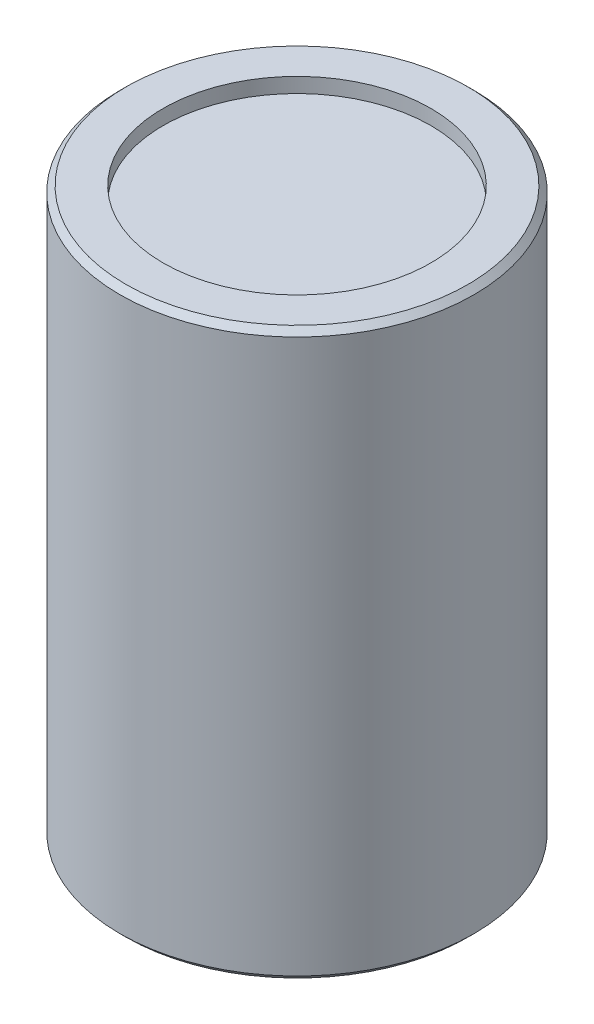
ISO-10303-21;
HEADER;
FILE_DESCRIPTION(('STEP AP214'),'2;1');
FILE_NAME('part.step','',(''),(''),'','','');
FILE_SCHEMA(('AUTOMOTIVE_DESIGN { 1 0 10303 214 1 1 1 1 }'));
ENDSEC;
DATA;
#1=APPLICATION_CONTEXT('core data for automotive mechanical design processes');
#2=APPLICATION_PROTOCOL_DEFINITION('international standard','automotive_design',2000,#1);
#3=PRODUCT_CONTEXT('',#1,'mechanical');
#4=PRODUCT('Part','Part','',(#3));
#5=PRODUCT_RELATED_PRODUCT_CATEGORY('part','',(#4));
#6=PRODUCT_DEFINITION_FORMATION('','',#4);
#7=PRODUCT_DEFINITION_CONTEXT('part definition',#1,'design');
#8=PRODUCT_DEFINITION('design','',#6,#7);
#9=PRODUCT_DEFINITION_SHAPE('','',#8);
#10=(LENGTH_UNIT() NAMED_UNIT(*) SI_UNIT(.MILLI.,.METRE.));
#11=(NAMED_UNIT(*) PLANE_ANGLE_UNIT() SI_UNIT($,.RADIAN.));
#12=(NAMED_UNIT(*) SI_UNIT($,.STERADIAN.) SOLID_ANGLE_UNIT());
#13=UNCERTAINTY_MEASURE_WITH_UNIT(LENGTH_MEASURE(1.E-05),#10,'distance_accuracy_value','');
#14=(GEOMETRIC_REPRESENTATION_CONTEXT(3) GLOBAL_UNCERTAINTY_ASSIGNED_CONTEXT((#13)) GLOBAL_UNIT_ASSIGNED_CONTEXT((#10,
#11,#12)) REPRESENTATION_CONTEXT('',''));
#15=CARTESIAN_POINT('',(0.,0.,0.));
#16=DIRECTION('',(0.,0.,1.));
#17=DIRECTION('',(1.,0.,0.));
#18=AXIS2_PLACEMENT_3D('',#15,#16,#17);
#19=CARTESIAN_POINT('',(0.,190.,0.));
#20=DIRECTION('',(0.,-1.,0.));
#21=DIRECTION('',(0.,0.,-1.));
#22=AXIS2_PLACEMENT_3D('',#19,#20,#21);
#23=CYLINDRICAL_SURFACE('',#22,59.5);
#24=CARTESIAN_POINT('',(0.,2.00000000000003,0.));
#25=DIRECTION('',(0.,1.,0.));
#26=DIRECTION('',(0.,0.,1.));
#27=AXIS2_PLACEMENT_3D('',#24,#25,#26);
#28=CIRCLE('',#27,59.5);
#29=CARTESIAN_POINT('',(0.,2.00000000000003,59.5));
#30=VERTEX_POINT('',#29);
#31=EDGE_CURVE('E49',#30,#30,#28,.T.);
#32=ORIENTED_EDGE('',*,*,#31,.T.);
#33=EDGE_LOOP('',(#32));
#34=FACE_BOUND('',#33,.T.);
#35=CARTESIAN_POINT('',(0.,188.,0.));
#36=DIRECTION('',(0.,1.,0.));
#37=DIRECTION('',(0.,0.,1.));
#38=AXIS2_PLACEMENT_3D('',#35,#36,#37);
#39=CIRCLE('',#38,59.5);
#40=CARTESIAN_POINT('',(0.,188.,59.5));
#41=VERTEX_POINT('',#40);
#42=EDGE_CURVE('E62',#41,#41,#39,.F.);
#43=ORIENTED_EDGE('',*,*,#42,.T.);
#44=EDGE_LOOP('',(#43));
#45=FACE_BOUND('',#44,.T.);
#46=ADVANCED_FACE('F37',(#34,#45),#23,.T.);
#47=CARTESIAN_POINT('',(0.,190.,0.));
#48=DIRECTION('',(0.,1.,0.));
#49=DIRECTION('',(0.,0.,1.));
#50=AXIS2_PLACEMENT_3D('',#47,#48,#49);
#51=PLANE('',#50);
#52=CARTESIAN_POINT('',(0.,190.,0.));
#53=DIRECTION('',(0.,1.,0.));
#54=DIRECTION('',(0.,0.,1.));
#55=AXIS2_PLACEMENT_3D('',#52,#53,#54);
#56=CIRCLE('',#55,57.5);
#57=CARTESIAN_POINT('',(0.,190.,57.5));
#58=VERTEX_POINT('',#57);
#59=EDGE_CURVE('E56',#58,#58,#56,.T.);
#60=ORIENTED_EDGE('',*,*,#59,.T.);
#61=EDGE_LOOP('',(#60));
#62=FACE_BOUND('',#61,.T.);
#63=CARTESIAN_POINT('',(0.,190.,0.));
#64=DIRECTION('',(0.,1.,0.));
#65=DIRECTION('',(0.,0.,1.));
#66=AXIS2_PLACEMENT_3D('',#63,#64,#65);
#67=CIRCLE('',#66,45.);
#68=CARTESIAN_POINT('',(0.,190.,45.));
#69=VERTEX_POINT('',#68);
#70=EDGE_CURVE('E57',#69,#69,#67,.T.);
#71=ORIENTED_EDGE('',*,*,#70,.F.);
#72=EDGE_LOOP('',(#71));
#73=FACE_BOUND('',#72,.T.);
#74=ADVANCED_FACE('F84',(#62,#73),#51,.T.);
#75=CARTESIAN_POINT('',(0.,0.,0.));
#76=DIRECTION('',(0.,1.,0.));
#77=DIRECTION('',(0.,0.,1.));
#78=AXIS2_PLACEMENT_3D('',#75,#76,#77);
#79=PLANE('',#78);
#80=CARTESIAN_POINT('',(0.,0.,0.));
#81=DIRECTION('',(0.,-1.,0.));
#82=DIRECTION('',(0.,0.,-1.));
#83=AXIS2_PLACEMENT_3D('',#80,#81,#82);
#84=CIRCLE('',#83,45.);
#85=CARTESIAN_POINT('',(0.,0.,-45.));
#86=VERTEX_POINT('',#85);
#87=EDGE_CURVE('E10',#86,#86,#84,.T.);
#88=ORIENTED_EDGE('',*,*,#87,.F.);
#89=EDGE_LOOP('',(#88));
#90=FACE_BOUND('',#89,.T.);
#91=CARTESIAN_POINT('',(0.,0.,0.));
#92=DIRECTION('',(0.,1.,0.));
#93=DIRECTION('',(0.,0.,1.));
#94=AXIS2_PLACEMENT_3D('',#91,#92,#93);
#95=CIRCLE('',#94,57.5);
#96=CARTESIAN_POINT('',(0.,0.,57.5));
#97=VERTEX_POINT('',#96);
#98=EDGE_CURVE('E41',#97,#97,#95,.F.);
#99=ORIENTED_EDGE('',*,*,#98,.T.);
#100=EDGE_LOOP('',(#99));
#101=FACE_BOUND('',#100,.T.);
#102=ADVANCED_FACE('F89',(#90,#101),#79,.F.);
#103=CARTESIAN_POINT('',(0.,185.,0.));
#104=DIRECTION('',(0.,1.,0.));
#105=DIRECTION('',(0.,0.,1.));
#106=AXIS2_PLACEMENT_3D('',#103,#104,#105);
#107=CYLINDRICAL_SURFACE('',#106,45.);
#108=CARTESIAN_POINT('',(0.,185.,0.));
#109=DIRECTION('',(0.,1.,0.));
#110=DIRECTION('',(0.,0.,1.));
#111=AXIS2_PLACEMENT_3D('',#108,#109,#110);
#112=CIRCLE('',#111,45.);
#113=CARTESIAN_POINT('',(0.,185.,45.));
#114=VERTEX_POINT('',#113);
#115=EDGE_CURVE('E53',#114,#114,#112,.T.);
#116=ORIENTED_EDGE('',*,*,#115,.F.);
#117=EDGE_LOOP('',(#116));
#118=FACE_BOUND('',#117,.T.);
#119=ORIENTED_EDGE('',*,*,#70,.T.);
#120=EDGE_LOOP('',(#119));
#121=FACE_BOUND('',#120,.T.);
#122=ADVANCED_FACE('F94',(#118,#121),#107,.F.);
#123=CARTESIAN_POINT('',(0.,185.,0.));
#124=DIRECTION('',(0.,1.,0.));
#125=DIRECTION('',(0.,0.,1.));
#126=AXIS2_PLACEMENT_3D('',#123,#124,#125);
#127=PLANE('',#126);
#128=ORIENTED_EDGE('',*,*,#115,.T.);
#129=EDGE_LOOP('',(#128));
#130=FACE_BOUND('',#129,.T.);
#131=ADVANCED_FACE('F80',(#130),#127,.T.);
#132=CARTESIAN_POINT('',(0.,190.,0.));
#133=DIRECTION('',(0.,-1.,0.));
#134=DIRECTION('',(0.,0.,-1.));
#135=AXIS2_PLACEMENT_3D('',#132,#133,#134);
#136=CONICAL_SURFACE('',#135,57.5,0.785398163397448);
#137=ORIENTED_EDGE('',*,*,#42,.F.);
#138=EDGE_LOOP('',(#137));
#139=FACE_BOUND('',#138,.T.);
#140=ORIENTED_EDGE('',*,*,#59,.F.);
#141=EDGE_LOOP('',(#140));
#142=FACE_BOUND('',#141,.T.);
#143=ADVANCED_FACE('F71',(#139,#142),#136,.T.);
#144=CARTESIAN_POINT('',(0.,2.00000000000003,0.));
#145=DIRECTION('',(0.,1.,0.));
#146=DIRECTION('',(0.,0.,1.));
#147=AXIS2_PLACEMENT_3D('',#144,#145,#146);
#148=CONICAL_SURFACE('',#147,59.5,0.785398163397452);
#149=ORIENTED_EDGE('',*,*,#98,.F.);
#150=EDGE_LOOP('',(#149));
#151=FACE_BOUND('',#150,.T.);
#152=ORIENTED_EDGE('',*,*,#31,.F.);
#153=EDGE_LOOP('',(#152));
#154=FACE_BOUND('',#153,.T.);
#155=ADVANCED_FACE('F39',(#151,#154),#148,.T.);
#156=CARTESIAN_POINT('',(0.,-6.,0.));
#157=DIRECTION('',(0.,1.,0.));
#158=DIRECTION('',(0.,0.,1.));
#159=AXIS2_PLACEMENT_3D('',#156,#157,#158);
#160=CYLINDRICAL_SURFACE('',#159,45.);
#161=CARTESIAN_POINT('',(0.,-6.,0.));
#162=DIRECTION('',(0.,-1.,0.));
#163=DIRECTION('',(0.,0.,-1.));
#164=AXIS2_PLACEMENT_3D('',#161,#162,#163);
#165=CIRCLE('',#164,45.);
#166=CARTESIAN_POINT('',(0.,-6.,-45.));
#167=VERTEX_POINT('',#166);
#168=EDGE_CURVE('E52',#167,#167,#165,.T.);
#169=ORIENTED_EDGE('',*,*,#168,.F.);
#170=EDGE_LOOP('',(#169));
#171=FACE_BOUND('',#170,.T.);
#172=ORIENTED_EDGE('',*,*,#87,.T.);
#173=EDGE_LOOP('',(#172));
#174=FACE_BOUND('',#173,.T.);
#175=ADVANCED_FACE('F70',(#171,#174),#160,.T.);
#176=CARTESIAN_POINT('',(0.,-6.,0.));
#177=DIRECTION('',(0.,-1.,0.));
#178=DIRECTION('',(0.,0.,-1.));
#179=AXIS2_PLACEMENT_3D('',#176,#177,#178);
#180=PLANE('',#179);
#181=ORIENTED_EDGE('',*,*,#168,.T.);
#182=EDGE_LOOP('',(#181));
#183=FACE_BOUND('',#182,.T.);
#184=ADVANCED_FACE('F77',(#183),#180,.T.);
#185=CLOSED_SHELL('',(#46,#74,#102,#122,#131,#143,#155,#175,#184));
#186=MANIFOLD_SOLID_BREP('B2',#185);
#187=ADVANCED_BREP_SHAPE_REPRESENTATION('',(#18,#186),#14);
#188=SHAPE_DEFINITION_REPRESENTATION(#9,#187);
ENDSEC;
END-ISO-10303-21;
